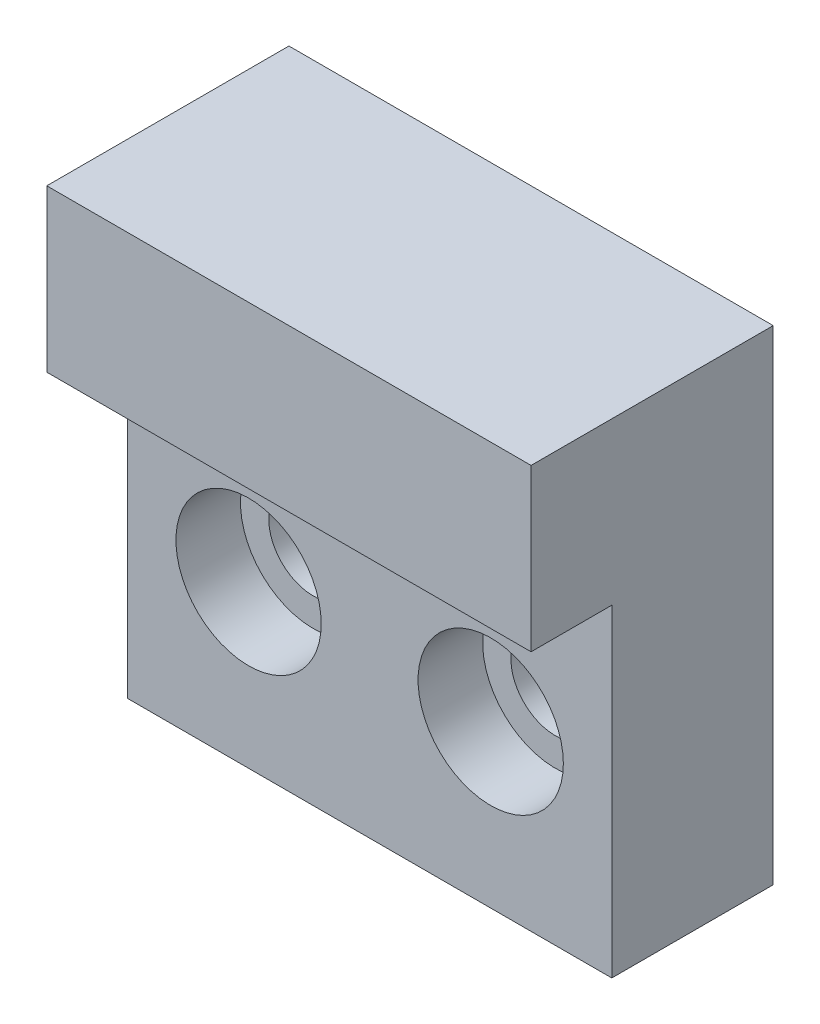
ISO-10303-21;
HEADER;
FILE_DESCRIPTION(('STEP AP214'),'2;1');
FILE_NAME('part.step','',(''),(''),'','','');
FILE_SCHEMA(('AUTOMOTIVE_DESIGN { 1 0 10303 214 1 1 1 1 }'));
ENDSEC;
DATA;
#1=APPLICATION_CONTEXT('core data for automotive mechanical design processes');
#2=APPLICATION_PROTOCOL_DEFINITION('international standard','automotive_design',2000,#1);
#3=PRODUCT_CONTEXT('',#1,'mechanical');
#4=PRODUCT('Part','Part','',(#3));
#5=PRODUCT_RELATED_PRODUCT_CATEGORY('part','',(#4));
#6=PRODUCT_DEFINITION_FORMATION('','',#4);
#7=PRODUCT_DEFINITION_CONTEXT('part definition',#1,'design');
#8=PRODUCT_DEFINITION('design','',#6,#7);
#9=PRODUCT_DEFINITION_SHAPE('','',#8);
#10=(LENGTH_UNIT() NAMED_UNIT(*) SI_UNIT(.MILLI.,.METRE.));
#11=(NAMED_UNIT(*) PLANE_ANGLE_UNIT() SI_UNIT($,.RADIAN.));
#12=(NAMED_UNIT(*) SI_UNIT($,.STERADIAN.) SOLID_ANGLE_UNIT());
#13=UNCERTAINTY_MEASURE_WITH_UNIT(LENGTH_MEASURE(1.E-05),#10,'distance_accuracy_value','');
#14=(GEOMETRIC_REPRESENTATION_CONTEXT(3) GLOBAL_UNCERTAINTY_ASSIGNED_CONTEXT((#13)) GLOBAL_UNIT_ASSIGNED_CONTEXT((#10,
#11,#12)) REPRESENTATION_CONTEXT('',''));
#15=CARTESIAN_POINT('',(0.,0.,0.));
#16=DIRECTION('',(0.,0.,1.));
#17=DIRECTION('',(1.,0.,0.));
#18=AXIS2_PLACEMENT_3D('',#15,#16,#17);
#19=CARTESIAN_POINT('',(30.,0.,10.));
#20=DIRECTION('',(0.,1.,0.));
#21=DIRECTION('',(0.,0.,1.));
#22=AXIS2_PLACEMENT_3D('',#19,#20,#21);
#23=PLANE('',#22);
#24=DIRECTION('',(0.,0.,-1.));
#25=VECTOR('',#24,1.);
#26=CARTESIAN_POINT('',(0.,0.,10.));
#27=LINE('',#26,#25);
#28=CARTESIAN_POINT('',(0.,0.,10.));
#29=VERTEX_POINT('',#28);
#30=CARTESIAN_POINT('',(0.,0.,0.));
#31=VERTEX_POINT('',#30);
#32=EDGE_CURVE('E117',#29,#31,#27,.T.);
#33=ORIENTED_EDGE('',*,*,#32,.T.);
#34=DIRECTION('',(-1.,0.,0.));
#35=VECTOR('',#34,1.);
#36=CARTESIAN_POINT('',(30.,0.,0.));
#37=LINE('',#36,#35);
#38=CARTESIAN_POINT('',(30.,0.,0.));
#39=VERTEX_POINT('',#38);
#40=EDGE_CURVE('E11',#39,#31,#37,.T.);
#41=ORIENTED_EDGE('',*,*,#40,.F.);
#42=DIRECTION('',(0.,0.,-1.));
#43=VECTOR('',#42,1.);
#44=CARTESIAN_POINT('',(30.,0.,10.));
#45=LINE('',#44,#43);
#46=CARTESIAN_POINT('',(30.,0.,10.));
#47=VERTEX_POINT('',#46);
#48=EDGE_CURVE('E128',#47,#39,#45,.T.);
#49=ORIENTED_EDGE('',*,*,#48,.F.);
#50=DIRECTION('',(-1.,0.,0.));
#51=VECTOR('',#50,1.);
#52=CARTESIAN_POINT('',(30.,0.,10.));
#53=LINE('',#52,#51);
#54=EDGE_CURVE('E113',#47,#29,#53,.T.);
#55=ORIENTED_EDGE('',*,*,#54,.T.);
#56=EDGE_LOOP('',(#33,#41,#49,#55));
#57=FACE_BOUND('',#56,.T.);
#58=ADVANCED_FACE('F33',(#57),#23,.F.);
#59=CARTESIAN_POINT('',(30.,0.,0.));
#60=DIRECTION('',(0.,0.,1.));
#61=DIRECTION('',(1.,0.,0.));
#62=AXIS2_PLACEMENT_3D('',#59,#60,#61);
#63=PLANE('',#62);
#64=CARTESIAN_POINT('',(7.5,10.,0.));
#65=DIRECTION('',(0.,0.,1.));
#66=DIRECTION('',(1.,0.,0.));
#67=AXIS2_PLACEMENT_3D('',#64,#65,#66);
#68=CIRCLE('',#67,2.75);
#69=CARTESIAN_POINT('',(10.25,10.,0.));
#70=VERTEX_POINT('',#69);
#71=EDGE_CURVE('E268',#70,#70,#68,.T.);
#72=ORIENTED_EDGE('',*,*,#71,.T.);
#73=EDGE_LOOP('',(#72));
#74=FACE_BOUND('',#73,.T.);
#75=CARTESIAN_POINT('',(22.5,10.,0.));
#76=DIRECTION('',(0.,0.,1.));
#77=DIRECTION('',(1.,0.,0.));
#78=AXIS2_PLACEMENT_3D('',#75,#76,#77);
#79=CIRCLE('',#78,2.75);
#80=CARTESIAN_POINT('',(25.25,10.,0.));
#81=VERTEX_POINT('',#80);
#82=EDGE_CURVE('E272',#81,#81,#79,.T.);
#83=ORIENTED_EDGE('',*,*,#82,.T.);
#84=EDGE_LOOP('',(#83));
#85=FACE_BOUND('',#84,.T.);
#86=DIRECTION('',(0.,1.,0.));
#87=VECTOR('',#86,1.);
#88=CARTESIAN_POINT('',(0.,0.,0.));
#89=LINE('',#88,#87);
#90=CARTESIAN_POINT('',(0.,30.,0.));
#91=VERTEX_POINT('',#90);
#92=EDGE_CURVE('E120',#31,#91,#89,.T.);
#93=ORIENTED_EDGE('',*,*,#92,.T.);
#94=DIRECTION('',(-1.,0.,0.));
#95=VECTOR('',#94,1.);
#96=CARTESIAN_POINT('',(30.,30.,0.));
#97=LINE('',#96,#95);
#98=CARTESIAN_POINT('',(30.,30.,0.));
#99=VERTEX_POINT('',#98);
#100=EDGE_CURVE('E41',#99,#91,#97,.T.);
#101=ORIENTED_EDGE('',*,*,#100,.F.);
#102=DIRECTION('',(0.,1.,0.));
#103=VECTOR('',#102,1.);
#104=CARTESIAN_POINT('',(30.,0.,0.));
#105=LINE('',#104,#103);
#106=EDGE_CURVE('E86',#39,#99,#105,.T.);
#107=ORIENTED_EDGE('',*,*,#106,.F.);
#108=ORIENTED_EDGE('',*,*,#40,.T.);
#109=EDGE_LOOP('',(#93,#101,#107,#108));
#110=FACE_BOUND('',#109,.T.);
#111=ADVANCED_FACE('F155',(#74,#85,#110),#63,.F.);
#112=CARTESIAN_POINT('',(30.,30.,0.));
#113=DIRECTION('',(0.,-1.,0.));
#114=DIRECTION('',(0.,0.,-1.));
#115=AXIS2_PLACEMENT_3D('',#112,#113,#114);
#116=PLANE('',#115);
#117=DIRECTION('',(0.,0.,1.));
#118=VECTOR('',#117,1.);
#119=CARTESIAN_POINT('',(0.,30.,0.));
#120=LINE('',#119,#118);
#121=CARTESIAN_POINT('',(0.,30.,15.));
#122=VERTEX_POINT('',#121);
#123=EDGE_CURVE('E123',#91,#122,#120,.T.);
#124=ORIENTED_EDGE('',*,*,#123,.T.);
#125=DIRECTION('',(-1.,0.,0.));
#126=VECTOR('',#125,1.);
#127=CARTESIAN_POINT('',(30.,30.,15.));
#128=LINE('',#127,#126);
#129=CARTESIAN_POINT('',(30.,30.,15.));
#130=VERTEX_POINT('',#129);
#131=EDGE_CURVE('E108',#130,#122,#128,.T.);
#132=ORIENTED_EDGE('',*,*,#131,.F.);
#133=DIRECTION('',(0.,0.,1.));
#134=VECTOR('',#133,1.);
#135=CARTESIAN_POINT('',(30.,30.,0.));
#136=LINE('',#135,#134);
#137=EDGE_CURVE('E99',#99,#130,#136,.T.);
#138=ORIENTED_EDGE('',*,*,#137,.F.);
#139=ORIENTED_EDGE('',*,*,#100,.T.);
#140=EDGE_LOOP('',(#124,#132,#138,#139));
#141=FACE_BOUND('',#140,.T.);
#142=ADVANCED_FACE('F134',(#141),#116,.F.);
#143=CARTESIAN_POINT('',(30.,30.,15.));
#144=DIRECTION('',(0.,0.,-1.));
#145=DIRECTION('',(0.,1.,0.));
#146=AXIS2_PLACEMENT_3D('',#143,#144,#145);
#147=PLANE('',#146);
#148=DIRECTION('',(0.,-1.,0.));
#149=VECTOR('',#148,1.);
#150=CARTESIAN_POINT('',(0.,30.,15.));
#151=LINE('',#150,#149);
#152=CARTESIAN_POINT('',(0.,20.,15.));
#153=VERTEX_POINT('',#152);
#154=EDGE_CURVE('E107',#122,#153,#151,.T.);
#155=ORIENTED_EDGE('',*,*,#154,.T.);
#156=DIRECTION('',(-1.,0.,0.));
#157=VECTOR('',#156,1.);
#158=CARTESIAN_POINT('',(30.,20.,15.));
#159=LINE('',#158,#157);
#160=CARTESIAN_POINT('',(30.,20.,15.));
#161=VERTEX_POINT('',#160);
#162=EDGE_CURVE('E104',#161,#153,#159,.T.);
#163=ORIENTED_EDGE('',*,*,#162,.F.);
#164=DIRECTION('',(0.,-1.,0.));
#165=VECTOR('',#164,1.);
#166=CARTESIAN_POINT('',(30.,30.,15.));
#167=LINE('',#166,#165);
#168=EDGE_CURVE('E93',#130,#161,#167,.T.);
#169=ORIENTED_EDGE('',*,*,#168,.F.);
#170=ORIENTED_EDGE('',*,*,#131,.T.);
#171=EDGE_LOOP('',(#155,#163,#169,#170));
#172=FACE_BOUND('',#171,.T.);
#173=ADVANCED_FACE('F105',(#172),#147,.F.);
#174=CARTESIAN_POINT('',(30.,20.,15.));
#175=DIRECTION('',(0.,1.,0.));
#176=DIRECTION('',(0.,0.,1.));
#177=AXIS2_PLACEMENT_3D('',#174,#175,#176);
#178=PLANE('',#177);
#179=DIRECTION('',(0.,0.,-1.));
#180=VECTOR('',#179,1.);
#181=CARTESIAN_POINT('',(0.,20.,15.));
#182=LINE('',#181,#180);
#183=CARTESIAN_POINT('',(0.,20.,10.));
#184=VERTEX_POINT('',#183);
#185=EDGE_CURVE('E72',#153,#184,#182,.T.);
#186=ORIENTED_EDGE('',*,*,#185,.T.);
#187=DIRECTION('',(-1.,0.,0.));
#188=VECTOR('',#187,1.);
#189=CARTESIAN_POINT('',(30.,20.,10.));
#190=LINE('',#189,#188);
#191=CARTESIAN_POINT('',(30.,20.,10.));
#192=VERTEX_POINT('',#191);
#193=EDGE_CURVE('E109',#192,#184,#190,.T.);
#194=ORIENTED_EDGE('',*,*,#193,.F.);
#195=DIRECTION('',(0.,0.,-1.));
#196=VECTOR('',#195,1.);
#197=CARTESIAN_POINT('',(30.,20.,15.));
#198=LINE('',#197,#196);
#199=EDGE_CURVE('E97',#161,#192,#198,.T.);
#200=ORIENTED_EDGE('',*,*,#199,.F.);
#201=ORIENTED_EDGE('',*,*,#162,.T.);
#202=EDGE_LOOP('',(#186,#194,#200,#201));
#203=FACE_BOUND('',#202,.T.);
#204=ADVANCED_FACE('F111',(#203),#178,.F.);
#205=CARTESIAN_POINT('',(30.,20.,10.));
#206=DIRECTION('',(0.,0.,-1.));
#207=DIRECTION('',(-1.,0.,0.));
#208=AXIS2_PLACEMENT_3D('',#205,#206,#207);
#209=PLANE('',#208);
#210=CARTESIAN_POINT('',(22.5,10.,10.));
#211=DIRECTION('',(0.,0.,1.));
#212=DIRECTION('',(1.,0.,0.));
#213=AXIS2_PLACEMENT_3D('',#210,#211,#212);
#214=CIRCLE('',#213,4.5);
#215=CARTESIAN_POINT('',(27.,10.,10.));
#216=VERTEX_POINT('',#215);
#217=EDGE_CURVE('E278',#216,#216,#214,.T.);
#218=ORIENTED_EDGE('',*,*,#217,.F.);
#219=EDGE_LOOP('',(#218));
#220=FACE_BOUND('',#219,.T.);
#221=CARTESIAN_POINT('',(7.5,10.,10.));
#222=DIRECTION('',(0.,0.,1.));
#223=DIRECTION('',(1.,0.,0.));
#224=AXIS2_PLACEMENT_3D('',#221,#222,#223);
#225=CIRCLE('',#224,4.5);
#226=CARTESIAN_POINT('',(12.,10.,10.));
#227=VERTEX_POINT('',#226);
#228=EDGE_CURVE('E282',#227,#227,#225,.T.);
#229=ORIENTED_EDGE('',*,*,#228,.F.);
#230=EDGE_LOOP('',(#229));
#231=FACE_BOUND('',#230,.T.);
#232=DIRECTION('',(0.,-1.,0.));
#233=VECTOR('',#232,1.);
#234=CARTESIAN_POINT('',(0.,20.,10.));
#235=LINE('',#234,#233);
#236=EDGE_CURVE('E78',#184,#29,#235,.T.);
#237=ORIENTED_EDGE('',*,*,#236,.T.);
#238=ORIENTED_EDGE('',*,*,#54,.F.);
#239=DIRECTION('',(0.,-1.,0.));
#240=VECTOR('',#239,1.);
#241=CARTESIAN_POINT('',(30.,20.,10.));
#242=LINE('',#241,#240);
#243=EDGE_CURVE('E49',#192,#47,#242,.T.);
#244=ORIENTED_EDGE('',*,*,#243,.F.);
#245=ORIENTED_EDGE('',*,*,#193,.T.);
#246=EDGE_LOOP('',(#237,#238,#244,#245));
#247=FACE_BOUND('',#246,.T.);
#248=ADVANCED_FACE('F141',(#220,#231,#247),#209,.F.);
#249=CARTESIAN_POINT('',(30.,0.,0.));
#250=DIRECTION('',(1.,0.,0.));
#251=DIRECTION('',(0.,0.,-1.));
#252=AXIS2_PLACEMENT_3D('',#249,#250,#251);
#253=PLANE('',#252);
#254=ORIENTED_EDGE('',*,*,#48,.T.);
#255=ORIENTED_EDGE('',*,*,#106,.T.);
#256=ORIENTED_EDGE('',*,*,#137,.T.);
#257=ORIENTED_EDGE('',*,*,#168,.T.);
#258=ORIENTED_EDGE('',*,*,#199,.T.);
#259=ORIENTED_EDGE('',*,*,#243,.T.);
#260=EDGE_LOOP('',(#254,#255,#256,#257,#258,#259));
#261=FACE_BOUND('',#260,.T.);
#262=ADVANCED_FACE('F95',(#261),#253,.T.);
#263=CARTESIAN_POINT('',(0.,0.,0.));
#264=DIRECTION('',(1.,0.,0.));
#265=DIRECTION('',(0.,0.,-1.));
#266=AXIS2_PLACEMENT_3D('',#263,#264,#265);
#267=PLANE('',#266);
#268=ORIENTED_EDGE('',*,*,#32,.F.);
#269=ORIENTED_EDGE('',*,*,#236,.F.);
#270=ORIENTED_EDGE('',*,*,#185,.F.);
#271=ORIENTED_EDGE('',*,*,#154,.F.);
#272=ORIENTED_EDGE('',*,*,#123,.F.);
#273=ORIENTED_EDGE('',*,*,#92,.F.);
#274=EDGE_LOOP('',(#268,#269,#270,#271,#272,#273));
#275=FACE_BOUND('',#274,.T.);
#276=ADVANCED_FACE('F137',(#275),#267,.F.);
#277=CARTESIAN_POINT('',(7.5,10.,6.));
#278=DIRECTION('',(0.,0.,1.));
#279=DIRECTION('',(1.,0.,0.));
#280=AXIS2_PLACEMENT_3D('',#277,#278,#279);
#281=CYLINDRICAL_SURFACE('',#280,4.5);
#282=CARTESIAN_POINT('',(7.5,10.,6.));
#283=DIRECTION('',(0.,0.,1.));
#284=DIRECTION('',(1.,0.,0.));
#285=AXIS2_PLACEMENT_3D('',#282,#283,#284);
#286=CIRCLE('',#285,4.5);
#287=CARTESIAN_POINT('',(12.,10.,6.));
#288=VERTEX_POINT('',#287);
#289=EDGE_CURVE('E121',#288,#288,#286,.T.);
#290=ORIENTED_EDGE('',*,*,#289,.F.);
#291=EDGE_LOOP('',(#290));
#292=FACE_BOUND('',#291,.T.);
#293=ORIENTED_EDGE('',*,*,#228,.T.);
#294=EDGE_LOOP('',(#293));
#295=FACE_BOUND('',#294,.T.);
#296=ADVANCED_FACE('F191',(#292,#295),#281,.F.);
#297=CARTESIAN_POINT('',(7.5,10.,6.));
#298=DIRECTION('',(0.,0.,1.));
#299=DIRECTION('',(1.,0.,0.));
#300=AXIS2_PLACEMENT_3D('',#297,#298,#299);
#301=PLANE('',#300);
#302=CARTESIAN_POINT('',(7.5,10.,6.));
#303=DIRECTION('',(0.,0.,1.));
#304=DIRECTION('',(1.,0.,0.));
#305=AXIS2_PLACEMENT_3D('',#302,#303,#304);
#306=CIRCLE('',#305,2.75);
#307=CARTESIAN_POINT('',(10.25,10.,6.));
#308=VERTEX_POINT('',#307);
#309=EDGE_CURVE('E266',#308,#308,#306,.T.);
#310=ORIENTED_EDGE('',*,*,#309,.F.);
#311=EDGE_LOOP('',(#310));
#312=FACE_BOUND('',#311,.T.);
#313=ORIENTED_EDGE('',*,*,#289,.T.);
#314=EDGE_LOOP('',(#313));
#315=FACE_BOUND('',#314,.T.);
#316=ADVANCED_FACE('F203',(#312,#315),#301,.T.);
#317=CARTESIAN_POINT('',(22.5,10.,6.));
#318=DIRECTION('',(0.,0.,1.));
#319=DIRECTION('',(1.,0.,0.));
#320=AXIS2_PLACEMENT_3D('',#317,#318,#319);
#321=CYLINDRICAL_SURFACE('',#320,4.5);
#322=CARTESIAN_POINT('',(22.5,10.,6.));
#323=DIRECTION('',(0.,0.,1.));
#324=DIRECTION('',(1.,0.,0.));
#325=AXIS2_PLACEMENT_3D('',#322,#323,#324);
#326=CIRCLE('',#325,4.5);
#327=CARTESIAN_POINT('',(27.,10.,6.));
#328=VERTEX_POINT('',#327);
#329=EDGE_CURVE('E279',#328,#328,#326,.T.);
#330=ORIENTED_EDGE('',*,*,#329,.F.);
#331=EDGE_LOOP('',(#330));
#332=FACE_BOUND('',#331,.T.);
#333=ORIENTED_EDGE('',*,*,#217,.T.);
#334=EDGE_LOOP('',(#333));
#335=FACE_BOUND('',#334,.T.);
#336=ADVANCED_FACE('F211',(#332,#335),#321,.F.);
#337=CARTESIAN_POINT('',(22.5,10.,6.));
#338=DIRECTION('',(0.,0.,1.));
#339=DIRECTION('',(1.,0.,0.));
#340=AXIS2_PLACEMENT_3D('',#337,#338,#339);
#341=PLANE('',#340);
#342=CARTESIAN_POINT('',(22.5,10.,6.));
#343=DIRECTION('',(0.,0.,1.));
#344=DIRECTION('',(1.,0.,0.));
#345=AXIS2_PLACEMENT_3D('',#342,#343,#344);
#346=CIRCLE('',#345,2.75);
#347=CARTESIAN_POINT('',(25.25,10.,6.));
#348=VERTEX_POINT('',#347);
#349=EDGE_CURVE('E269',#348,#348,#346,.T.);
#350=ORIENTED_EDGE('',*,*,#349,.F.);
#351=EDGE_LOOP('',(#350));
#352=FACE_BOUND('',#351,.T.);
#353=ORIENTED_EDGE('',*,*,#329,.T.);
#354=EDGE_LOOP('',(#353));
#355=FACE_BOUND('',#354,.T.);
#356=ADVANCED_FACE('F215',(#352,#355),#341,.T.);
#357=CARTESIAN_POINT('',(22.5,10.,-3.));
#358=DIRECTION('',(0.,0.,1.));
#359=DIRECTION('',(1.,0.,0.));
#360=AXIS2_PLACEMENT_3D('',#357,#358,#359);
#361=CYLINDRICAL_SURFACE('',#360,2.75);
#362=ORIENTED_EDGE('',*,*,#349,.T.);
#363=EDGE_LOOP('',(#362));
#364=FACE_BOUND('',#363,.T.);
#365=ORIENTED_EDGE('',*,*,#82,.F.);
#366=EDGE_LOOP('',(#365));
#367=FACE_BOUND('',#366,.T.);
#368=ADVANCED_FACE('F239',(#364,#367),#361,.F.);
#369=CARTESIAN_POINT('',(7.5,10.,-3.));
#370=DIRECTION('',(0.,0.,1.));
#371=DIRECTION('',(1.,0.,0.));
#372=AXIS2_PLACEMENT_3D('',#369,#370,#371);
#373=CYLINDRICAL_SURFACE('',#372,2.75);
#374=ORIENTED_EDGE('',*,*,#309,.T.);
#375=EDGE_LOOP('',(#374));
#376=FACE_BOUND('',#375,.T.);
#377=ORIENTED_EDGE('',*,*,#71,.F.);
#378=EDGE_LOOP('',(#377));
#379=FACE_BOUND('',#378,.T.);
#380=ADVANCED_FACE('F249',(#376,#379),#373,.F.);
#381=CLOSED_SHELL('',(#58,#111,#142,#173,#204,#248,#262,#276,#296,#316,#336,#356,#368,#380));
#382=MANIFOLD_SOLID_BREP('B2',#381);
#383=ADVANCED_BREP_SHAPE_REPRESENTATION('',(#18,#382),#14);
#384=SHAPE_DEFINITION_REPRESENTATION(#9,#383);
ENDSEC;
END-ISO-10303-21;
